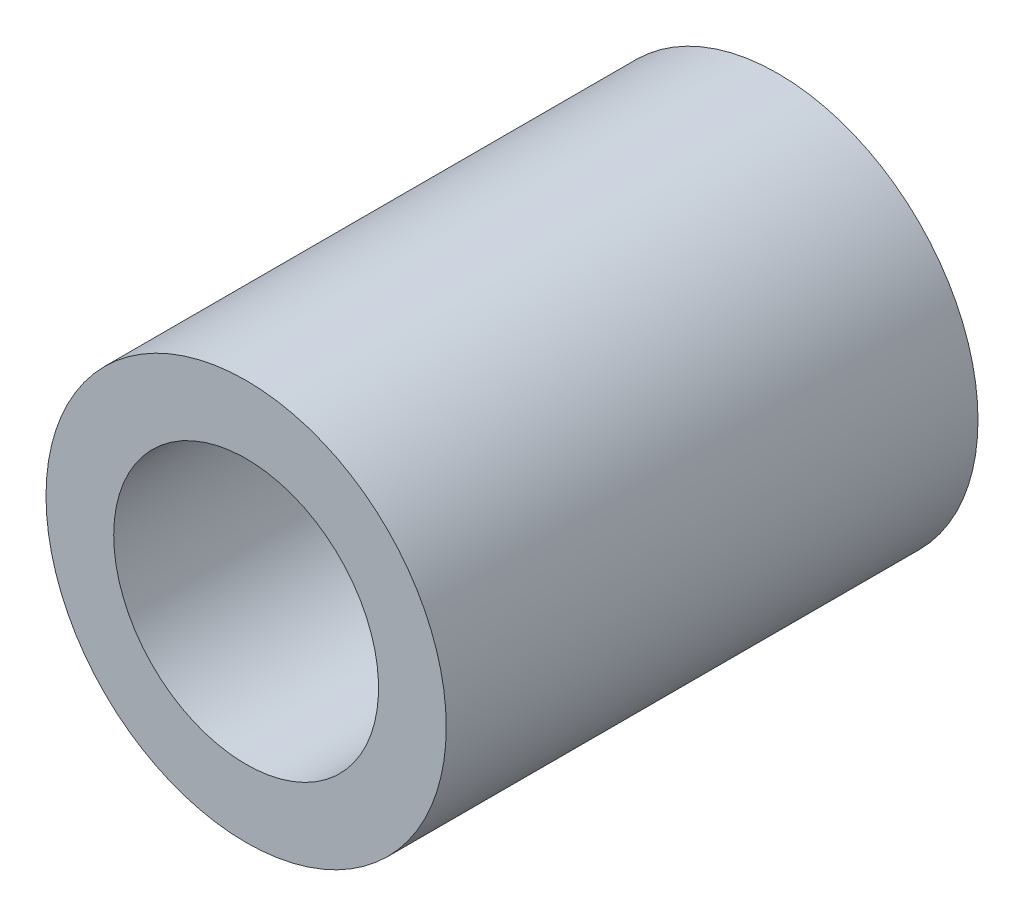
ISO-10303-21;
HEADER;
FILE_DESCRIPTION(('STEP AP214'),'2;1');
FILE_NAME('part.step','',(''),(''),'','','');
FILE_SCHEMA(('AUTOMOTIVE_DESIGN { 1 0 10303 214 1 1 1 1 }'));
ENDSEC;
DATA;
#1=APPLICATION_CONTEXT('core data for automotive mechanical design processes');
#2=APPLICATION_PROTOCOL_DEFINITION('international standard','automotive_design',2000,#1);
#3=PRODUCT_CONTEXT('',#1,'mechanical');
#4=PRODUCT('Part','Part','',(#3));
#5=PRODUCT_RELATED_PRODUCT_CATEGORY('part','',(#4));
#6=PRODUCT_DEFINITION_FORMATION('','',#4);
#7=PRODUCT_DEFINITION_CONTEXT('part definition',#1,'design');
#8=PRODUCT_DEFINITION('design','',#6,#7);
#9=PRODUCT_DEFINITION_SHAPE('','',#8);
#10=(LENGTH_UNIT() NAMED_UNIT(*) SI_UNIT(.MILLI.,.METRE.));
#11=(NAMED_UNIT(*) PLANE_ANGLE_UNIT() SI_UNIT($,.RADIAN.));
#12=(NAMED_UNIT(*) SI_UNIT($,.STERADIAN.) SOLID_ANGLE_UNIT());
#13=UNCERTAINTY_MEASURE_WITH_UNIT(LENGTH_MEASURE(1.E-05),#10,'distance_accuracy_value','');
#14=(GEOMETRIC_REPRESENTATION_CONTEXT(3) GLOBAL_UNCERTAINTY_ASSIGNED_CONTEXT((#13)) GLOBAL_UNIT_ASSIGNED_CONTEXT((#10,
#11,#12)) REPRESENTATION_CONTEXT('',''));
#15=CARTESIAN_POINT('',(0.,0.,0.));
#16=DIRECTION('',(0.,0.,1.));
#17=DIRECTION('',(1.,0.,0.));
#18=AXIS2_PLACEMENT_3D('',#15,#16,#17);
#19=CARTESIAN_POINT('',(216.156963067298,212.528981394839,-5.94086516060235));
#20=DIRECTION('',(0.,0.,-1.));
#21=DIRECTION('',(-1.,0.,0.));
#22=AXIS2_PLACEMENT_3D('',#19,#20,#21);
#23=CYLINDRICAL_SURFACE('',#22,3.2125);
#24=CARTESIAN_POINT('',(216.156963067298,212.528981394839,12.9));
#25=DIRECTION('',(0.,0.,-1.));
#26=DIRECTION('',(-1.,0.,0.));
#27=AXIS2_PLACEMENT_3D('',#24,#25,#26);
#28=CIRCLE('',#27,3.2125);
#29=CARTESIAN_POINT('',(212.944463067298,212.528981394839,12.9));
#30=VERTEX_POINT('',#29);
#31=EDGE_CURVE('E26',#30,#30,#28,.T.);
#32=ORIENTED_EDGE('',*,*,#31,.F.);
#33=EDGE_LOOP('',(#32));
#34=FACE_BOUND('',#33,.T.);
#35=CARTESIAN_POINT('',(216.156963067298,212.528981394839,0.));
#36=DIRECTION('',(0.,0.,-1.));
#37=DIRECTION('',(-1.,0.,0.));
#38=AXIS2_PLACEMENT_3D('',#35,#36,#37);
#39=CIRCLE('',#38,3.2125);
#40=CARTESIAN_POINT('',(212.944463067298,212.528981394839,0.));
#41=VERTEX_POINT('',#40);
#42=EDGE_CURVE('E17',#41,#41,#39,.T.);
#43=ORIENTED_EDGE('',*,*,#42,.T.);
#44=EDGE_LOOP('',(#43));
#45=FACE_BOUND('',#44,.T.);
#46=ADVANCED_FACE('F14',(#34,#45),#23,.F.);
#47=CARTESIAN_POINT('',(216.598326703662,212.528981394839,0.));
#48=DIRECTION('',(0.,0.,1.));
#49=DIRECTION('',(1.,0.,0.));
#50=AXIS2_PLACEMENT_3D('',#47,#48,#49);
#51=PLANE('',#50);
#52=CARTESIAN_POINT('',(216.156963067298,212.528981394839,0.));
#53=DIRECTION('',(0.,0.,1.));
#54=DIRECTION('',(1.,0.,0.));
#55=AXIS2_PLACEMENT_3D('',#52,#53,#54);
#56=CIRCLE('',#55,4.855);
#57=CARTESIAN_POINT('',(221.011963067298,212.528981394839,0.));
#58=VERTEX_POINT('',#57);
#59=EDGE_CURVE('E21',#58,#58,#56,.T.);
#60=ORIENTED_EDGE('',*,*,#59,.F.);
#61=EDGE_LOOP('',(#60));
#62=FACE_BOUND('',#61,.T.);
#63=ORIENTED_EDGE('',*,*,#42,.F.);
#64=EDGE_LOOP('',(#63));
#65=FACE_BOUND('',#64,.T.);
#66=ADVANCED_FACE('F35',(#62,#65),#51,.F.);
#67=CARTESIAN_POINT('',(223.406963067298,212.528981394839,12.9));
#68=DIRECTION('',(0.,0.,1.));
#69=DIRECTION('',(1.,0.,0.));
#70=AXIS2_PLACEMENT_3D('',#67,#68,#69);
#71=PLANE('',#70);
#72=CARTESIAN_POINT('',(216.156963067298,212.528981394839,12.9));
#73=DIRECTION('',(0.,0.,1.));
#74=DIRECTION('',(1.,0.,0.));
#75=AXIS2_PLACEMENT_3D('',#72,#73,#74);
#76=CIRCLE('',#75,4.855);
#77=CARTESIAN_POINT('',(221.011963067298,212.528981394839,12.9));
#78=VERTEX_POINT('',#77);
#79=EDGE_CURVE('E9',#78,#78,#76,.F.);
#80=ORIENTED_EDGE('',*,*,#79,.F.);
#81=EDGE_LOOP('',(#80));
#82=FACE_BOUND('',#81,.T.);
#83=ORIENTED_EDGE('',*,*,#31,.T.);
#84=EDGE_LOOP('',(#83));
#85=FACE_BOUND('',#84,.T.);
#86=ADVANCED_FACE('F37',(#82,#85),#71,.T.);
#87=CARTESIAN_POINT('',(216.156963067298,212.528981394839,0.));
#88=DIRECTION('',(0.,0.,1.));
#89=DIRECTION('',(1.,0.,0.));
#90=AXIS2_PLACEMENT_3D('',#87,#88,#89);
#91=CYLINDRICAL_SURFACE('',#90,4.855);
#92=ORIENTED_EDGE('',*,*,#59,.T.);
#93=EDGE_LOOP('',(#92));
#94=FACE_BOUND('',#93,.T.);
#95=ORIENTED_EDGE('',*,*,#79,.T.);
#96=EDGE_LOOP('',(#95));
#97=FACE_BOUND('',#96,.T.);
#98=ADVANCED_FACE('F44',(#94,#97),#91,.T.);
#99=CLOSED_SHELL('',(#46,#66,#86,#98));
#100=MANIFOLD_SOLID_BREP('B1',#99);
#101=ADVANCED_BREP_SHAPE_REPRESENTATION('',(#18,#100),#14);
#102=SHAPE_DEFINITION_REPRESENTATION(#9,#101);
ENDSEC;
END-ISO-10303-21;
